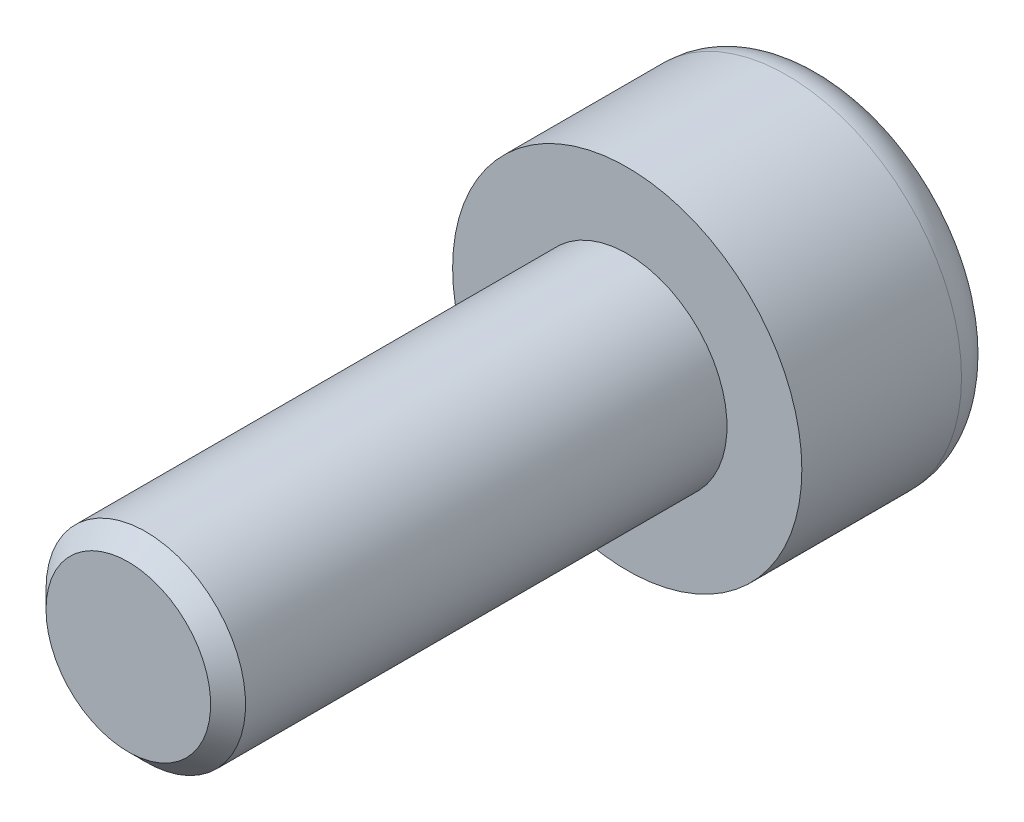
ISO-10303-21;
HEADER;
FILE_DESCRIPTION(('STEP AP214'),'2;1');
FILE_NAME('part.step','',(''),(''),'','','');
FILE_SCHEMA(('AUTOMOTIVE_DESIGN { 1 0 10303 214 1 1 1 1 }'));
ENDSEC;
DATA;
#1=APPLICATION_CONTEXT('core data for automotive mechanical design processes');
#2=APPLICATION_PROTOCOL_DEFINITION('international standard','automotive_design',2000,#1);
#3=PRODUCT_CONTEXT('',#1,'mechanical');
#4=PRODUCT('Part','Part','',(#3));
#5=PRODUCT_RELATED_PRODUCT_CATEGORY('part','',(#4));
#6=PRODUCT_DEFINITION_FORMATION('','',#4);
#7=PRODUCT_DEFINITION_CONTEXT('part definition',#1,'design');
#8=PRODUCT_DEFINITION('design','',#6,#7);
#9=PRODUCT_DEFINITION_SHAPE('','',#8);
#10=(LENGTH_UNIT() NAMED_UNIT(*) SI_UNIT(.MILLI.,.METRE.));
#11=(NAMED_UNIT(*) PLANE_ANGLE_UNIT() SI_UNIT($,.RADIAN.));
#12=(NAMED_UNIT(*) SI_UNIT($,.STERADIAN.) SOLID_ANGLE_UNIT());
#13=UNCERTAINTY_MEASURE_WITH_UNIT(LENGTH_MEASURE(1.E-05),#10,'distance_accuracy_value','');
#14=(GEOMETRIC_REPRESENTATION_CONTEXT(3) GLOBAL_UNCERTAINTY_ASSIGNED_CONTEXT((#13)) GLOBAL_UNIT_ASSIGNED_CONTEXT((#10,
#11,#12)) REPRESENTATION_CONTEXT('',''));
#15=CARTESIAN_POINT('',(0.,0.,0.));
#16=DIRECTION('',(0.,0.,1.));
#17=DIRECTION('',(1.,0.,0.));
#18=AXIS2_PLACEMENT_3D('',#15,#16,#17);
#19=CARTESIAN_POINT('',(-1.5,-0.866025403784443,2.5));
#20=DIRECTION('',(-0.500000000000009,-0.866025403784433,0.));
#21=DIRECTION('',(0.866025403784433,-0.500000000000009,0.));
#22=AXIS2_PLACEMENT_3D('',#19,#20,#21);
#23=PLANE('',#22);
#24=DIRECTION('',(0.,0.,1.));
#25=VECTOR('',#24,1.);
#26=CARTESIAN_POINT('',(-1.5,-0.866025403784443,2.5));
#27=LINE('',#26,#25);
#28=CARTESIAN_POINT('',(-1.5,-0.866025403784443,0.));
#29=VERTEX_POINT('',#28);
#30=CARTESIAN_POINT('',(-1.5,-0.866025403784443,2.5));
#31=VERTEX_POINT('',#30);
#32=EDGE_CURVE('E86',#29,#31,#27,.T.);
#33=ORIENTED_EDGE('',*,*,#32,.T.);
#34=DIRECTION('',(0.866025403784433,-0.500000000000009,0.));
#35=VECTOR('',#34,1.);
#36=CARTESIAN_POINT('',(-1.5,-0.866025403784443,2.5));
#37=LINE('',#36,#35);
#38=CARTESIAN_POINT('',(0.,-1.7320508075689,2.5));
#39=VERTEX_POINT('',#38);
#40=EDGE_CURVE('E75',#39,#31,#37,.F.);
#41=ORIENTED_EDGE('',*,*,#40,.F.);
#42=DIRECTION('',(0.,0.,1.));
#43=VECTOR('',#42,1.);
#44=CARTESIAN_POINT('',(0.,-1.7320508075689,2.5));
#45=LINE('',#44,#43);
#46=CARTESIAN_POINT('',(0.,-1.7320508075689,0.));
#47=VERTEX_POINT('',#46);
#48=EDGE_CURVE('E95',#39,#47,#45,.F.);
#49=ORIENTED_EDGE('',*,*,#48,.T.);
#50=DIRECTION('',(0.866025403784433,-0.500000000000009,0.));
#51=VECTOR('',#50,1.);
#52=CARTESIAN_POINT('',(-1.5,-0.866025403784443,0.));
#53=LINE('',#52,#51);
#54=EDGE_CURVE('E70',#29,#47,#53,.T.);
#55=ORIENTED_EDGE('',*,*,#54,.F.);
#56=EDGE_LOOP('',(#33,#41,#49,#55));
#57=FACE_BOUND('',#56,.T.);
#58=ADVANCED_FACE('F15',(#57),#23,.F.);
#59=CARTESIAN_POINT('',(-1.5,0.866025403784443,2.5));
#60=DIRECTION('',(-1.,0.,0.));
#61=DIRECTION('',(0.,0.,1.));
#62=AXIS2_PLACEMENT_3D('',#59,#60,#61);
#63=PLANE('',#62);
#64=DIRECTION('',(0.,0.,1.));
#65=VECTOR('',#64,1.);
#66=CARTESIAN_POINT('',(-1.5,0.866025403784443,2.5));
#67=LINE('',#66,#65);
#68=CARTESIAN_POINT('',(-1.5,0.866025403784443,0.));
#69=VERTEX_POINT('',#68);
#70=CARTESIAN_POINT('',(-1.5,0.866025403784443,2.5));
#71=VERTEX_POINT('',#70);
#72=EDGE_CURVE('E91',#69,#71,#67,.T.);
#73=ORIENTED_EDGE('',*,*,#72,.T.);
#74=DIRECTION('',(0.,1.,0.));
#75=VECTOR('',#74,1.);
#76=CARTESIAN_POINT('',(-1.5,0.866025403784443,2.5));
#77=LINE('',#76,#75);
#78=EDGE_CURVE('E79',#31,#71,#77,.T.);
#79=ORIENTED_EDGE('',*,*,#78,.F.);
#80=ORIENTED_EDGE('',*,*,#32,.F.);
#81=DIRECTION('',(0.,1.,0.));
#82=VECTOR('',#81,1.);
#83=CARTESIAN_POINT('',(-1.5,0.866025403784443,0.));
#84=LINE('',#83,#82);
#85=EDGE_CURVE('E93',#69,#29,#84,.F.);
#86=ORIENTED_EDGE('',*,*,#85,.F.);
#87=EDGE_LOOP('',(#73,#79,#80,#86));
#88=FACE_BOUND('',#87,.T.);
#89=ADVANCED_FACE('F89',(#88),#63,.F.);
#90=CARTESIAN_POINT('',(1.5,-0.866025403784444,2.5));
#91=DIRECTION('',(0.500000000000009,-0.866025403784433,0.));
#92=DIRECTION('',(0.866025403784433,0.500000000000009,0.));
#93=AXIS2_PLACEMENT_3D('',#90,#91,#92);
#94=PLANE('',#93);
#95=ORIENTED_EDGE('',*,*,#48,.F.);
#96=DIRECTION('',(0.866025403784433,0.500000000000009,0.));
#97=VECTOR('',#96,1.);
#98=CARTESIAN_POINT('',(0.,-1.7320508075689,2.5));
#99=LINE('',#98,#97);
#100=CARTESIAN_POINT('',(1.5,-0.866025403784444,2.5));
#101=VERTEX_POINT('',#100);
#102=EDGE_CURVE('E82',#39,#101,#99,.T.);
#103=ORIENTED_EDGE('',*,*,#102,.T.);
#104=DIRECTION('',(0.,0.,-1.));
#105=VECTOR('',#104,1.);
#106=CARTESIAN_POINT('',(1.5,-0.866025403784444,2.5));
#107=LINE('',#106,#105);
#108=CARTESIAN_POINT('',(1.5,-0.866025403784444,0.));
#109=VERTEX_POINT('',#108);
#110=EDGE_CURVE('E291',#101,#109,#107,.T.);
#111=ORIENTED_EDGE('',*,*,#110,.T.);
#112=DIRECTION('',(0.866025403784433,0.500000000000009,0.));
#113=VECTOR('',#112,1.);
#114=CARTESIAN_POINT('',(1.5,-0.866025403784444,0.));
#115=LINE('',#114,#113);
#116=EDGE_CURVE('E280',#47,#109,#115,.T.);
#117=ORIENTED_EDGE('',*,*,#116,.F.);
#118=EDGE_LOOP('',(#95,#103,#111,#117));
#119=FACE_BOUND('',#118,.T.);
#120=ADVANCED_FACE('F243',(#119),#94,.F.);
#121=CARTESIAN_POINT('',(0.,1.7320508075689,2.5));
#122=DIRECTION('',(-0.500000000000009,0.866025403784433,0.));
#123=DIRECTION('',(-0.866025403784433,-0.500000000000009,0.));
#124=AXIS2_PLACEMENT_3D('',#121,#122,#123);
#125=PLANE('',#124);
#126=DIRECTION('',(0.,0.,1.));
#127=VECTOR('',#126,1.);
#128=CARTESIAN_POINT('',(0.,1.7320508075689,2.5));
#129=LINE('',#128,#127);
#130=CARTESIAN_POINT('',(0.,1.7320508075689,0.));
#131=VERTEX_POINT('',#130);
#132=CARTESIAN_POINT('',(0.,1.7320508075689,2.5));
#133=VERTEX_POINT('',#132);
#134=EDGE_CURVE('E296',#131,#133,#129,.T.);
#135=ORIENTED_EDGE('',*,*,#134,.T.);
#136=DIRECTION('',(-0.866025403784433,-0.500000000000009,0.));
#137=VECTOR('',#136,1.);
#138=CARTESIAN_POINT('',(0.,1.7320508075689,2.5));
#139=LINE('',#138,#137);
#140=EDGE_CURVE('E287',#133,#71,#139,.T.);
#141=ORIENTED_EDGE('',*,*,#140,.T.);
#142=ORIENTED_EDGE('',*,*,#72,.F.);
#143=DIRECTION('',(-0.866025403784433,-0.500000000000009,0.));
#144=VECTOR('',#143,1.);
#145=CARTESIAN_POINT('',(0.,1.7320508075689,0.));
#146=LINE('',#145,#144);
#147=EDGE_CURVE('E284',#131,#69,#146,.T.);
#148=ORIENTED_EDGE('',*,*,#147,.F.);
#149=EDGE_LOOP('',(#135,#141,#142,#148));
#150=FACE_BOUND('',#149,.T.);
#151=ADVANCED_FACE('F234',(#150),#125,.F.);
#152=CARTESIAN_POINT('',(-2.99999999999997,0.,2.5));
#153=DIRECTION('',(0.,0.,1.));
#154=DIRECTION('',(1.,0.,0.));
#155=AXIS2_PLACEMENT_3D('',#152,#153,#154);
#156=PLANE('',#155);
#157=DIRECTION('',(-0.866025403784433,0.500000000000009,0.));
#158=VECTOR('',#157,1.);
#159=CARTESIAN_POINT('',(0.,1.7320508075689,2.5));
#160=LINE('',#159,#158);
#161=CARTESIAN_POINT('',(1.5,0.866025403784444,2.5));
#162=VERTEX_POINT('',#161);
#163=EDGE_CURVE('E119',#133,#162,#160,.F.);
#164=ORIENTED_EDGE('',*,*,#163,.T.);
#165=DIRECTION('',(0.,1.,0.));
#166=VECTOR('',#165,1.);
#167=CARTESIAN_POINT('',(1.5,0.866025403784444,2.5));
#168=LINE('',#167,#166);
#169=EDGE_CURVE('E289',#162,#101,#168,.F.);
#170=ORIENTED_EDGE('',*,*,#169,.T.);
#171=ORIENTED_EDGE('',*,*,#102,.F.);
#172=ORIENTED_EDGE('',*,*,#40,.T.);
#173=ORIENTED_EDGE('',*,*,#78,.T.);
#174=ORIENTED_EDGE('',*,*,#140,.F.);
#175=EDGE_LOOP('',(#164,#170,#171,#172,#173,#174));
#176=FACE_BOUND('',#175,.T.);
#177=ADVANCED_FACE('F76',(#176),#156,.F.);
#178=CARTESIAN_POINT('',(1.5,0.866025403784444,2.5));
#179=DIRECTION('',(1.,0.,0.));
#180=DIRECTION('',(0.,0.,-1.));
#181=AXIS2_PLACEMENT_3D('',#178,#179,#180);
#182=PLANE('',#181);
#183=ORIENTED_EDGE('',*,*,#110,.F.);
#184=ORIENTED_EDGE('',*,*,#169,.F.);
#185=DIRECTION('',(0.,0.,1.));
#186=VECTOR('',#185,1.);
#187=CARTESIAN_POINT('',(1.5,0.866025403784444,2.5));
#188=LINE('',#187,#186);
#189=CARTESIAN_POINT('',(1.5,0.866025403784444,0.));
#190=VERTEX_POINT('',#189);
#191=EDGE_CURVE('E112',#162,#190,#188,.F.);
#192=ORIENTED_EDGE('',*,*,#191,.T.);
#193=DIRECTION('',(0.,1.,0.));
#194=VECTOR('',#193,1.);
#195=CARTESIAN_POINT('',(1.5,0.866025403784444,0.));
#196=LINE('',#195,#194);
#197=EDGE_CURVE('E293',#109,#190,#196,.T.);
#198=ORIENTED_EDGE('',*,*,#197,.F.);
#199=EDGE_LOOP('',(#183,#184,#192,#198));
#200=FACE_BOUND('',#199,.T.);
#201=ADVANCED_FACE('F164',(#200),#182,.F.);
#202=CARTESIAN_POINT('',(0.,1.7320508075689,2.5));
#203=DIRECTION('',(0.500000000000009,0.866025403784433,0.));
#204=DIRECTION('',(-0.866025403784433,0.500000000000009,0.));
#205=AXIS2_PLACEMENT_3D('',#202,#203,#204);
#206=PLANE('',#205);
#207=ORIENTED_EDGE('',*,*,#191,.F.);
#208=ORIENTED_EDGE('',*,*,#163,.F.);
#209=ORIENTED_EDGE('',*,*,#134,.F.);
#210=DIRECTION('',(0.866025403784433,-0.500000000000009,0.));
#211=VECTOR('',#210,1.);
#212=CARTESIAN_POINT('',(0.,1.7320508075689,0.));
#213=LINE('',#212,#211);
#214=EDGE_CURVE('E110',#131,#190,#213,.T.);
#215=ORIENTED_EDGE('',*,*,#214,.T.);
#216=EDGE_LOOP('',(#207,#208,#209,#215));
#217=FACE_BOUND('',#216,.T.);
#218=ADVANCED_FACE('F158',(#217),#206,.F.);
#219=CARTESIAN_POINT('',(0.,0.,0.));
#220=DIRECTION('',(0.,0.,1.));
#221=DIRECTION('',(1.,0.,0.));
#222=AXIS2_PLACEMENT_3D('',#219,#220,#221);
#223=PLANE('',#222);
#224=ORIENTED_EDGE('',*,*,#147,.T.);
#225=ORIENTED_EDGE('',*,*,#85,.T.);
#226=ORIENTED_EDGE('',*,*,#54,.T.);
#227=ORIENTED_EDGE('',*,*,#116,.T.);
#228=ORIENTED_EDGE('',*,*,#197,.T.);
#229=ORIENTED_EDGE('',*,*,#214,.F.);
#230=EDGE_LOOP('',(#224,#225,#226,#227,#228,#229));
#231=FACE_BOUND('',#230,.T.);
#232=CARTESIAN_POINT('',(0.,0.,0.));
#233=DIRECTION('',(0.,0.,1.));
#234=DIRECTION('',(1.,0.,0.));
#235=AXIS2_PLACEMENT_3D('',#232,#233,#234);
#236=CIRCLE('',#235,2.7);
#237=CARTESIAN_POINT('',(2.7,0.,0.));
#238=VERTEX_POINT('',#237);
#239=CARTESIAN_POINT('',(-2.7,0.,0.));
#240=VERTEX_POINT('',#239);
#241=EDGE_CURVE('E108',#238,#240,#236,.T.);
#242=ORIENTED_EDGE('',*,*,#241,.F.);
#243=CARTESIAN_POINT('',(0.,0.,0.));
#244=DIRECTION('',(0.,0.,1.));
#245=DIRECTION('',(-1.,0.,0.));
#246=AXIS2_PLACEMENT_3D('',#243,#244,#245);
#247=CIRCLE('',#246,2.7);
#248=EDGE_CURVE('E34',#240,#238,#247,.T.);
#249=ORIENTED_EDGE('',*,*,#248,.F.);
#250=EDGE_LOOP('',(#242,#249));
#251=FACE_BOUND('',#250,.T.);
#252=ADVANCED_FACE('F139',(#231,#251),#223,.F.);
#253=CARTESIAN_POINT('',(0.,0.,0.8));
#254=DIRECTION('',(0.,0.,1.));
#255=DIRECTION('',(1.,0.,0.));
#256=AXIS2_PLACEMENT_3D('',#253,#254,#255);
#257=TOROIDAL_SURFACE('',#256,2.7,0.8);
#258=CARTESIAN_POINT('',(0.,0.,0.8));
#259=DIRECTION('',(0.,0.,-1.));
#260=DIRECTION('',(-1.,0.,0.));
#261=AXIS2_PLACEMENT_3D('',#258,#259,#260);
#262=CIRCLE('',#261,3.5);
#263=CARTESIAN_POINT('',(-3.5,0.,0.8));
#264=VERTEX_POINT('',#263);
#265=EDGE_CURVE('E105',#264,#264,#262,.F.);
#266=ORIENTED_EDGE('',*,*,#265,.F.);
#267=EDGE_LOOP('',(#266));
#268=FACE_BOUND('',#267,.T.);
#269=ORIENTED_EDGE('',*,*,#241,.T.);
#270=ORIENTED_EDGE('',*,*,#248,.T.);
#271=EDGE_LOOP('',(#269,#270));
#272=FACE_BOUND('',#271,.T.);
#273=ADVANCED_FACE('F107',(#268,#272),#257,.T.);
#274=CARTESIAN_POINT('',(0.,0.,14.));
#275=DIRECTION('',(0.,0.,1.));
#276=DIRECTION('',(1.,0.,0.));
#277=AXIS2_PLACEMENT_3D('',#274,#275,#276);
#278=PLANE('',#277);
#279=CARTESIAN_POINT('',(0.,0.,14.00000000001));
#280=DIRECTION('',(0.,0.,-1.));
#281=DIRECTION('',(-1.,0.,0.));
#282=AXIS2_PLACEMENT_3D('',#279,#280,#281);
#283=CIRCLE('',#282,1.64999999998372);
#284=CARTESIAN_POINT('',(-1.64999999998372,0.,14.00000000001));
#285=VERTEX_POINT('',#284);
#286=EDGE_CURVE('E103',#285,#285,#283,.T.);
#287=ORIENTED_EDGE('',*,*,#286,.F.);
#288=EDGE_LOOP('',(#287));
#289=FACE_BOUND('',#288,.T.);
#290=ADVANCED_FACE('F138',(#289),#278,.T.);
#291=CARTESIAN_POINT('',(0.,0.,4.));
#292=DIRECTION('',(0.,0.,-1.));
#293=DIRECTION('',(-1.,0.,0.));
#294=AXIS2_PLACEMENT_3D('',#291,#292,#293);
#295=CYLINDRICAL_SURFACE('',#294,3.5);
#296=ORIENTED_EDGE('',*,*,#265,.T.);
#297=EDGE_LOOP('',(#296));
#298=FACE_BOUND('',#297,.T.);
#299=CARTESIAN_POINT('',(0.,0.,4.));
#300=DIRECTION('',(0.,0.,-1.));
#301=DIRECTION('',(-1.,0.,0.));
#302=AXIS2_PLACEMENT_3D('',#299,#300,#301);
#303=CIRCLE('',#302,3.5);
#304=CARTESIAN_POINT('',(-3.5,0.,4.));
#305=VERTEX_POINT('',#304);
#306=EDGE_CURVE('E100',#305,#305,#303,.F.);
#307=ORIENTED_EDGE('',*,*,#306,.F.);
#308=EDGE_LOOP('',(#307));
#309=FACE_BOUND('',#308,.T.);
#310=ADVANCED_FACE('F180',(#298,#309),#295,.T.);
#311=CARTESIAN_POINT('',(0.,0.,13.650000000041));
#312=DIRECTION('',(0.,0.,-1.));
#313=DIRECTION('',(-1.,0.,0.));
#314=AXIS2_PLACEMENT_3D('',#311,#312,#313);
#315=CONICAL_SURFACE('',#314,1.99999999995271,0.785398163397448);
#316=CARTESIAN_POINT('',(0.,0.,13.65));
#317=DIRECTION('',(0.,0.,-1.));
#318=DIRECTION('',(-1.,0.,0.));
#319=AXIS2_PLACEMENT_3D('',#316,#317,#318);
#320=CIRCLE('',#319,2.);
#321=CARTESIAN_POINT('',(-2.,0.,13.65));
#322=VERTEX_POINT('',#321);
#323=EDGE_CURVE('E26',#322,#322,#320,.T.);
#324=ORIENTED_EDGE('',*,*,#323,.F.);
#325=EDGE_LOOP('',(#324));
#326=FACE_BOUND('',#325,.T.);
#327=ORIENTED_EDGE('',*,*,#286,.T.);
#328=EDGE_LOOP('',(#327));
#329=FACE_BOUND('',#328,.T.);
#330=ADVANCED_FACE('F174',(#326,#329),#315,.T.);
#331=CARTESIAN_POINT('',(0.,0.,4.));
#332=DIRECTION('',(0.,0.,1.));
#333=DIRECTION('',(1.,0.,0.));
#334=AXIS2_PLACEMENT_3D('',#331,#332,#333);
#335=PLANE('',#334);
#336=CARTESIAN_POINT('',(0.,0.,4.));
#337=DIRECTION('',(0.,0.,-1.));
#338=DIRECTION('',(-1.,0.,0.));
#339=AXIS2_PLACEMENT_3D('',#336,#337,#338);
#340=CIRCLE('',#339,2.);
#341=CARTESIAN_POINT('',(-2.,0.,4.));
#342=VERTEX_POINT('',#341);
#343=EDGE_CURVE('E10',#342,#342,#340,.F.);
#344=ORIENTED_EDGE('',*,*,#343,.F.);
#345=EDGE_LOOP('',(#344));
#346=FACE_BOUND('',#345,.T.);
#347=ORIENTED_EDGE('',*,*,#306,.T.);
#348=EDGE_LOOP('',(#347));
#349=FACE_BOUND('',#348,.T.);
#350=ADVANCED_FACE('F168',(#346,#349),#335,.T.);
#351=CARTESIAN_POINT('',(0.,0.,14.));
#352=DIRECTION('',(0.,0.,-1.));
#353=DIRECTION('',(-1.,0.,0.));
#354=AXIS2_PLACEMENT_3D('',#351,#352,#353);
#355=CYLINDRICAL_SURFACE('',#354,2.);
#356=ORIENTED_EDGE('',*,*,#343,.T.);
#357=EDGE_LOOP('',(#356));
#358=FACE_BOUND('',#357,.T.);
#359=ORIENTED_EDGE('',*,*,#323,.T.);
#360=EDGE_LOOP('',(#359));
#361=FACE_BOUND('',#360,.T.);
#362=ADVANCED_FACE('F166',(#358,#361),#355,.T.);
#363=CLOSED_SHELL('',(#58,#89,#120,#151,#177,#201,#218,#252,#273,#290,#310,#330,#350,#362));
#364=MANIFOLD_SOLID_BREP('B1',#363);
#365=ADVANCED_BREP_SHAPE_REPRESENTATION('',(#18,#364),#14);
#366=SHAPE_DEFINITION_REPRESENTATION(#9,#365);
ENDSEC;
END-ISO-10303-21;
